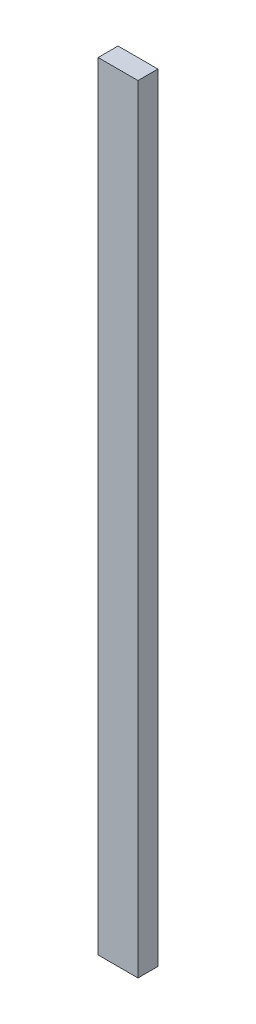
from build123d import *

# Parameters (mm, degrees)
SKETCH1_W           = 101.6
SKETCH1_H           = 50.8
BOSS_EXTRUDE1_DEPTH = 1981.2


with BuildPart() as part:
    # Sketch1 → Boss-Extrude1 (new body)
    with BuildSketch(Plane(origin=(0, 0, 0), x_dir=(1, 0, 0), z_dir=(0, 1, 0))):
        Rectangle(SKETCH1_W, SKETCH1_H)
    extrude(amount=BOSS_EXTRUDE1_DEPTH)


solid = part.part
